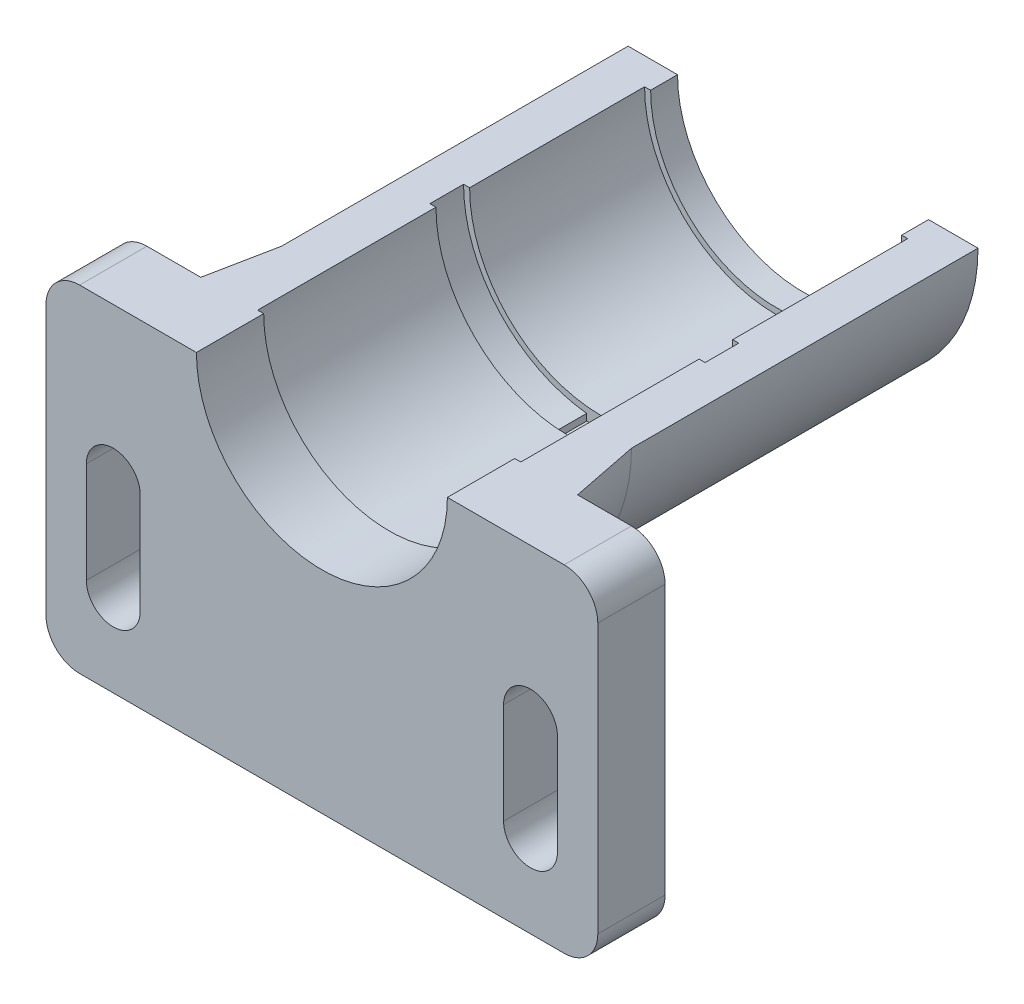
ISO-10303-21;
HEADER;
FILE_DESCRIPTION(('STEP AP214'),'2;1');
FILE_NAME('part.step','',(''),(''),'','','');
FILE_SCHEMA(('AUTOMOTIVE_DESIGN { 1 0 10303 214 1 1 1 1 }'));
ENDSEC;
DATA;
#1=APPLICATION_CONTEXT('core data for automotive mechanical design processes');
#2=APPLICATION_PROTOCOL_DEFINITION('international standard','automotive_design',2000,#1);
#3=PRODUCT_CONTEXT('',#1,'mechanical');
#4=PRODUCT('Part','Part','',(#3));
#5=PRODUCT_RELATED_PRODUCT_CATEGORY('part','',(#4));
#6=PRODUCT_DEFINITION_FORMATION('','',#4);
#7=PRODUCT_DEFINITION_CONTEXT('part definition',#1,'design');
#8=PRODUCT_DEFINITION('design','',#6,#7);
#9=PRODUCT_DEFINITION_SHAPE('','',#8);
#10=(LENGTH_UNIT() NAMED_UNIT(*) SI_UNIT(.MILLI.,.METRE.));
#11=(NAMED_UNIT(*) PLANE_ANGLE_UNIT() SI_UNIT($,.RADIAN.));
#12=(NAMED_UNIT(*) SI_UNIT($,.STERADIAN.) SOLID_ANGLE_UNIT());
#13=UNCERTAINTY_MEASURE_WITH_UNIT(LENGTH_MEASURE(1.E-05),#10,'distance_accuracy_value','');
#14=(GEOMETRIC_REPRESENTATION_CONTEXT(3) GLOBAL_UNCERTAINTY_ASSIGNED_CONTEXT((#13)) GLOBAL_UNIT_ASSIGNED_CONTEXT((#10,
#11,#12)) REPRESENTATION_CONTEXT('',''));
#15=CARTESIAN_POINT('',(0.,0.,0.));
#16=DIRECTION('',(0.,0.,1.));
#17=DIRECTION('',(1.,0.,0.));
#18=AXIS2_PLACEMENT_3D('',#15,#16,#17);
#19=CARTESIAN_POINT('',(19.55,0.,57.5));
#20=DIRECTION('',(0.,-1.,0.));
#21=DIRECTION('',(0.,0.,-1.));
#22=AXIS2_PLACEMENT_3D('',#19,#20,#21);
#23=PLANE('',#22);
#24=DIRECTION('',(-1.,0.,0.));
#25=VECTOR('',#24,1.);
#26=CARTESIAN_POINT('',(18.65,0.,67.5));
#27=LINE('',#26,#25);
#28=CARTESIAN_POINT('',(36.,0.,67.5));
#29=VERTEX_POINT('',#28);
#30=CARTESIAN_POINT('',(18.65,0.,67.5));
#31=VERTEX_POINT('',#30);
#32=EDGE_CURVE('E415',#29,#31,#27,.T.);
#33=ORIENTED_EDGE('',*,*,#32,.F.);
#34=DIRECTION('',(0.,0.,-1.));
#35=VECTOR('',#34,1.);
#36=CARTESIAN_POINT('',(36.,0.,57.5));
#37=LINE('',#36,#35);
#38=CARTESIAN_POINT('',(36.,0.,57.5));
#39=VERTEX_POINT('',#38);
#40=EDGE_CURVE('E491',#29,#39,#37,.T.);
#41=ORIENTED_EDGE('',*,*,#40,.T.);
#42=DIRECTION('',(-1.,0.,0.));
#43=VECTOR('',#42,1.);
#44=CARTESIAN_POINT('',(18.65,0.,57.5));
#45=LINE('',#44,#43);
#46=CARTESIAN_POINT('',(28.,0.,57.5));
#47=VERTEX_POINT('',#46);
#48=EDGE_CURVE('E431',#39,#47,#45,.T.);
#49=ORIENTED_EDGE('',*,*,#48,.T.);
#50=DIRECTION('',(0.196116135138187,0.,0.98058067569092));
#51=VECTOR('',#50,1.);
#52=CARTESIAN_POINT('',(0.,0.,-82.499999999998));
#53=LINE('',#52,#51);
#54=CARTESIAN_POINT('',(26.,0.,47.5000000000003));
#55=VERTEX_POINT('',#54);
#56=EDGE_CURVE('E465',#47,#55,#53,.F.);
#57=ORIENTED_EDGE('',*,*,#56,.T.);
#58=DIRECTION('',(0.,0.,-1.));
#59=VECTOR('',#58,1.);
#60=CARTESIAN_POINT('',(26.,0.,57.5));
#61=LINE('',#60,#59);
#62=CARTESIAN_POINT('',(26.,0.,-4.));
#63=VERTEX_POINT('',#62);
#64=EDGE_CURVE('E259',#55,#63,#61,.T.);
#65=ORIENTED_EDGE('',*,*,#64,.T.);
#66=DIRECTION('',(1.,0.,0.));
#67=VECTOR('',#66,1.);
#68=CARTESIAN_POINT('',(18.65,0.,-4.));
#69=LINE('',#68,#67);
#70=CARTESIAN_POINT('',(18.65,0.,-4.));
#71=VERTEX_POINT('',#70);
#72=EDGE_CURVE('E252',#71,#63,#69,.T.);
#73=ORIENTED_EDGE('',*,*,#72,.F.);
#74=DIRECTION('',(0.,0.,1.));
#75=VECTOR('',#74,1.);
#76=CARTESIAN_POINT('',(18.65,0.,-4.));
#77=LINE('',#76,#75);
#78=CARTESIAN_POINT('',(18.65,0.,0.));
#79=VERTEX_POINT('',#78);
#80=EDGE_CURVE('E256',#71,#79,#77,.T.);
#81=ORIENTED_EDGE('',*,*,#80,.T.);
#82=DIRECTION('',(1.,0.,0.));
#83=VECTOR('',#82,1.);
#84=CARTESIAN_POINT('',(18.65,0.,0.));
#85=LINE('',#84,#83);
#86=CARTESIAN_POINT('',(19.55,0.,0.));
#87=VERTEX_POINT('',#86);
#88=EDGE_CURVE('E536',#79,#87,#85,.T.);
#89=ORIENTED_EDGE('',*,*,#88,.T.);
#90=DIRECTION('',(0.,0.,-1.));
#91=VECTOR('',#90,1.);
#92=CARTESIAN_POINT('',(19.55,0.,57.5));
#93=LINE('',#92,#91);
#94=CARTESIAN_POINT('',(19.55,0.,26.));
#95=VERTEX_POINT('',#94);
#96=EDGE_CURVE('E455',#95,#87,#93,.T.);
#97=ORIENTED_EDGE('',*,*,#96,.F.);
#98=DIRECTION('',(1.,0.,0.));
#99=VECTOR('',#98,1.);
#100=CARTESIAN_POINT('',(0.,0.,26.));
#101=LINE('',#100,#99);
#102=CARTESIAN_POINT('',(20.45,0.,26.));
#103=VERTEX_POINT('',#102);
#104=EDGE_CURVE('E382',#95,#103,#101,.T.);
#105=ORIENTED_EDGE('',*,*,#104,.T.);
#106=DIRECTION('',(0.,0.,-1.));
#107=VECTOR('',#106,1.);
#108=CARTESIAN_POINT('',(20.45,0.,31.));
#109=LINE('',#108,#107);
#110=CARTESIAN_POINT('',(20.45,0.,31.));
#111=VERTEX_POINT('',#110);
#112=EDGE_CURVE('E400',#111,#103,#109,.T.);
#113=ORIENTED_EDGE('',*,*,#112,.F.);
#114=DIRECTION('',(1.,0.,0.));
#115=VECTOR('',#114,1.);
#116=CARTESIAN_POINT('',(0.,0.,31.));
#117=LINE('',#116,#115);
#118=CARTESIAN_POINT('',(19.55,0.,31.));
#119=VERTEX_POINT('',#118);
#120=EDGE_CURVE('E359',#119,#111,#117,.T.);
#121=ORIENTED_EDGE('',*,*,#120,.F.);
#122=CARTESIAN_POINT('',(19.55,0.,57.5));
#123=VERTEX_POINT('',#122);
#124=EDGE_CURVE('E456',#123,#119,#93,.T.);
#125=ORIENTED_EDGE('',*,*,#124,.F.);
#126=CARTESIAN_POINT('',(18.65,0.,57.5));
#127=VERTEX_POINT('',#126);
#128=EDGE_CURVE('E430',#123,#127,#45,.T.);
#129=ORIENTED_EDGE('',*,*,#128,.T.);
#130=DIRECTION('',(0.,0.,-1.));
#131=VECTOR('',#130,1.);
#132=CARTESIAN_POINT('',(18.65,0.,67.5));
#133=LINE('',#132,#131);
#134=EDGE_CURVE('E440',#31,#127,#133,.T.);
#135=ORIENTED_EDGE('',*,*,#134,.F.);
#136=EDGE_LOOP('',(#33,#41,#49,#57,#65,#73,#81,#89,#97,#105,#113,#121,#125,#129,#135));
#137=FACE_BOUND('',#136,.T.);
#138=ADVANCED_FACE('F36',(#137),#23,.F.);
#139=CARTESIAN_POINT('',(0.,0.,57.5));
#140=DIRECTION('',(0.,0.,-1.));
#141=DIRECTION('',(-1.,0.,0.));
#142=AXIS2_PLACEMENT_3D('',#139,#140,#141);
#143=CYLINDRICAL_SURFACE('',#142,19.55);
#144=CARTESIAN_POINT('',(0.,0.,31.));
#145=DIRECTION('',(0.,0.,-1.));
#146=DIRECTION('',(-1.,0.,0.));
#147=AXIS2_PLACEMENT_3D('',#144,#145,#146);
#148=CIRCLE('',#147,19.55);
#149=CARTESIAN_POINT('',(-19.55,0.,31.));
#150=VERTEX_POINT('',#149);
#151=EDGE_CURVE('E357',#150,#119,#148,.F.);
#152=ORIENTED_EDGE('',*,*,#151,.F.);
#153=DIRECTION('',(0.,0.,-1.));
#154=VECTOR('',#153,1.);
#155=CARTESIAN_POINT('',(-19.55,0.,57.5));
#156=LINE('',#155,#154);
#157=CARTESIAN_POINT('',(-19.55,0.,57.5));
#158=VERTEX_POINT('',#157);
#159=EDGE_CURVE('E452',#158,#150,#156,.T.);
#160=ORIENTED_EDGE('',*,*,#159,.F.);
#161=CARTESIAN_POINT('',(0.,0.,57.5));
#162=DIRECTION('',(0.,0.,-1.));
#163=DIRECTION('',(1.,0.,0.));
#164=AXIS2_PLACEMENT_3D('',#161,#162,#163);
#165=CIRCLE('',#164,19.55);
#166=EDGE_CURVE('E444',#123,#158,#165,.T.);
#167=ORIENTED_EDGE('',*,*,#166,.F.);
#168=ORIENTED_EDGE('',*,*,#124,.T.);
#169=EDGE_LOOP('',(#152,#160,#167,#168));
#170=FACE_BOUND('',#169,.T.);
#171=ADVANCED_FACE('F577',(#170),#143,.F.);
#172=CARTESIAN_POINT('',(-26.,0.,57.5));
#173=DIRECTION('',(0.,-1.,0.));
#174=DIRECTION('',(0.,0.,-1.));
#175=AXIS2_PLACEMENT_3D('',#172,#173,#174);
#176=PLANE('',#175);
#177=DIRECTION('',(-1.,0.,0.));
#178=VECTOR('',#177,1.);
#179=CARTESIAN_POINT('',(-41.,0.,57.5));
#180=LINE('',#179,#178);
#181=CARTESIAN_POINT('',(-28.,0.,57.5));
#182=VERTEX_POINT('',#181);
#183=CARTESIAN_POINT('',(-36.,0.,57.5));
#184=VERTEX_POINT('',#183);
#185=EDGE_CURVE('E435',#182,#184,#180,.T.);
#186=ORIENTED_EDGE('',*,*,#185,.T.);
#187=DIRECTION('',(0.,0.,-1.));
#188=VECTOR('',#187,1.);
#189=CARTESIAN_POINT('',(-36.,0.,57.5));
#190=LINE('',#189,#188);
#191=CARTESIAN_POINT('',(-36.,0.,67.5));
#192=VERTEX_POINT('',#191);
#193=EDGE_CURVE('E482',#184,#192,#190,.F.);
#194=ORIENTED_EDGE('',*,*,#193,.T.);
#195=DIRECTION('',(-1.,0.,0.));
#196=VECTOR('',#195,1.);
#197=CARTESIAN_POINT('',(-41.,0.,67.5));
#198=LINE('',#197,#196);
#199=CARTESIAN_POINT('',(-18.65,0.,67.5));
#200=VERTEX_POINT('',#199);
#201=EDGE_CURVE('E419',#200,#192,#198,.T.);
#202=ORIENTED_EDGE('',*,*,#201,.F.);
#203=DIRECTION('',(0.,0.,-1.));
#204=VECTOR('',#203,1.);
#205=CARTESIAN_POINT('',(-18.65,0.,67.5));
#206=LINE('',#205,#204);
#207=CARTESIAN_POINT('',(-18.65,0.,57.5));
#208=VERTEX_POINT('',#207);
#209=EDGE_CURVE('E422',#200,#208,#206,.T.);
#210=ORIENTED_EDGE('',*,*,#209,.T.);
#211=EDGE_CURVE('E410',#208,#158,#180,.T.);
#212=ORIENTED_EDGE('',*,*,#211,.T.);
#213=ORIENTED_EDGE('',*,*,#159,.T.);
#214=DIRECTION('',(1.,0.,0.));
#215=VECTOR('',#214,1.);
#216=CARTESIAN_POINT('',(0.,0.,31.));
#217=LINE('',#216,#215);
#218=CARTESIAN_POINT('',(-20.45,0.,31.));
#219=VERTEX_POINT('',#218);
#220=EDGE_CURVE('E355',#219,#150,#217,.T.);
#221=ORIENTED_EDGE('',*,*,#220,.F.);
#222=DIRECTION('',(0.,0.,-1.));
#223=VECTOR('',#222,1.);
#224=CARTESIAN_POINT('',(-20.45,0.,31.));
#225=LINE('',#224,#223);
#226=CARTESIAN_POINT('',(-20.45,0.,26.));
#227=VERTEX_POINT('',#226);
#228=EDGE_CURVE('E402',#219,#227,#225,.T.);
#229=ORIENTED_EDGE('',*,*,#228,.T.);
#230=DIRECTION('',(1.,0.,0.));
#231=VECTOR('',#230,1.);
#232=CARTESIAN_POINT('',(0.,0.,26.));
#233=LINE('',#232,#231);
#234=CARTESIAN_POINT('',(-19.55,0.,26.));
#235=VERTEX_POINT('',#234);
#236=EDGE_CURVE('E376',#227,#235,#233,.T.);
#237=ORIENTED_EDGE('',*,*,#236,.T.);
#238=CARTESIAN_POINT('',(-19.55,0.,0.));
#239=VERTEX_POINT('',#238);
#240=EDGE_CURVE('E451',#235,#239,#156,.T.);
#241=ORIENTED_EDGE('',*,*,#240,.T.);
#242=DIRECTION('',(1.,0.,0.));
#243=VECTOR('',#242,1.);
#244=CARTESIAN_POINT('',(-26.,0.,0.));
#245=LINE('',#244,#243);
#246=CARTESIAN_POINT('',(-18.65,0.,0.));
#247=VERTEX_POINT('',#246);
#248=EDGE_CURVE('E273',#239,#247,#245,.T.);
#249=ORIENTED_EDGE('',*,*,#248,.T.);
#250=DIRECTION('',(0.,0.,1.));
#251=VECTOR('',#250,1.);
#252=CARTESIAN_POINT('',(-18.65,0.,-4.));
#253=LINE('',#252,#251);
#254=CARTESIAN_POINT('',(-18.65,0.,-4.));
#255=VERTEX_POINT('',#254);
#256=EDGE_CURVE('E279',#255,#247,#253,.T.);
#257=ORIENTED_EDGE('',*,*,#256,.F.);
#258=DIRECTION('',(1.,0.,0.));
#259=VECTOR('',#258,1.);
#260=CARTESIAN_POINT('',(-26.,0.,-4.));
#261=LINE('',#260,#259);
#262=CARTESIAN_POINT('',(-26.,0.,-4.));
#263=VERTEX_POINT('',#262);
#264=EDGE_CURVE('E269',#263,#255,#261,.T.);
#265=ORIENTED_EDGE('',*,*,#264,.F.);
#266=DIRECTION('',(0.,0.,-1.));
#267=VECTOR('',#266,1.);
#268=CARTESIAN_POINT('',(-26.,0.,57.5));
#269=LINE('',#268,#267);
#270=CARTESIAN_POINT('',(-26.,0.,47.5000000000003));
#271=VERTEX_POINT('',#270);
#272=EDGE_CURVE('E447',#271,#263,#269,.T.);
#273=ORIENTED_EDGE('',*,*,#272,.F.);
#274=DIRECTION('',(0.196116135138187,0.,-0.98058067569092));
#275=VECTOR('',#274,1.);
#276=CARTESIAN_POINT('',(0.,0.,-82.499999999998));
#277=LINE('',#276,#275);
#278=EDGE_CURVE('E467',#271,#182,#277,.F.);
#279=ORIENTED_EDGE('',*,*,#278,.T.);
#280=EDGE_LOOP('',(#186,#194,#202,#210,#212,#213,#221,#229,#237,#241,#249,#257,#265,#273,#279));
#281=FACE_BOUND('',#280,.T.);
#282=ADVANCED_FACE('F539',(#281),#176,.F.);
#283=CARTESIAN_POINT('',(0.,0.,57.5));
#284=DIRECTION('',(0.,0.,-1.));
#285=DIRECTION('',(-1.,0.,0.));
#286=AXIS2_PLACEMENT_3D('',#283,#284,#285);
#287=CYLINDRICAL_SURFACE('',#286,26.);
#288=ORIENTED_EDGE('',*,*,#64,.F.);
#289=CARTESIAN_POINT('',(0.,0.,47.5000000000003));
#290=DIRECTION('',(0.,0.,1.));
#291=DIRECTION('',(1.,0.,0.));
#292=AXIS2_PLACEMENT_3D('',#289,#290,#291);
#293=CIRCLE('',#292,26.);
#294=EDGE_CURVE('E463',#55,#271,#293,.F.);
#295=ORIENTED_EDGE('',*,*,#294,.T.);
#296=ORIENTED_EDGE('',*,*,#272,.T.);
#297=CARTESIAN_POINT('',(0.,0.,-4.));
#298=DIRECTION('',(0.,0.,-1.));
#299=DIRECTION('',(-1.,0.,0.));
#300=AXIS2_PLACEMENT_3D('',#297,#298,#299);
#301=CIRCLE('',#300,26.);
#302=EDGE_CURVE('E263',#63,#263,#301,.T.);
#303=ORIENTED_EDGE('',*,*,#302,.F.);
#304=EDGE_LOOP('',(#288,#295,#296,#303));
#305=FACE_BOUND('',#304,.T.);
#306=ADVANCED_FACE('F530',(#305),#287,.T.);
#307=ORIENTED_EDGE('',*,*,#240,.F.);
#308=CARTESIAN_POINT('',(0.,0.,26.));
#309=DIRECTION('',(0.,0.,-1.));
#310=DIRECTION('',(-1.,0.,0.));
#311=AXIS2_PLACEMENT_3D('',#308,#309,#310);
#312=CIRCLE('',#311,19.55);
#313=EDGE_CURVE('E379',#235,#95,#312,.F.);
#314=ORIENTED_EDGE('',*,*,#313,.T.);
#315=ORIENTED_EDGE('',*,*,#96,.T.);
#316=CARTESIAN_POINT('',(0.,0.,0.));
#317=DIRECTION('',(0.,0.,-1.));
#318=DIRECTION('',(1.,0.,0.));
#319=AXIS2_PLACEMENT_3D('',#316,#317,#318);
#320=CIRCLE('',#319,19.55);
#321=EDGE_CURVE('E443',#87,#239,#320,.T.);
#322=ORIENTED_EDGE('',*,*,#321,.T.);
#323=EDGE_LOOP('',(#307,#314,#315,#322));
#324=FACE_BOUND('',#323,.T.);
#325=ADVANCED_FACE('F546',(#324),#143,.F.);
#326=CARTESIAN_POINT('',(0.,0.,57.5));
#327=DIRECTION('',(0.,0.,1.));
#328=DIRECTION('',(1.,0.,0.));
#329=AXIS2_PLACEMENT_3D('',#326,#327,#328);
#330=PLANE('',#329);
#331=DIRECTION('',(0.,-1.,0.));
#332=VECTOR('',#331,1.);
#333=CARTESIAN_POINT('',(27.,0.,57.5));
#334=LINE('',#333,#332);
#335=CARTESIAN_POINT('',(27.,-22.5,57.5));
#336=VERTEX_POINT('',#335);
#337=CARTESIAN_POINT('',(27.,-37.5,57.5));
#338=VERTEX_POINT('',#337);
#339=EDGE_CURVE('E341',#336,#338,#334,.T.);
#340=ORIENTED_EDGE('',*,*,#339,.T.);
#341=CARTESIAN_POINT('',(31.,-37.5,57.5));
#342=DIRECTION('',(0.,0.,1.));
#343=DIRECTION('',(1.,0.,0.));
#344=AXIS2_PLACEMENT_3D('',#341,#342,#343);
#345=CIRCLE('',#344,4.);
#346=CARTESIAN_POINT('',(35.,-37.5,57.5));
#347=VERTEX_POINT('',#346);
#348=EDGE_CURVE('E344',#338,#347,#345,.T.);
#349=ORIENTED_EDGE('',*,*,#348,.T.);
#350=DIRECTION('',(0.,1.,0.));
#351=VECTOR('',#350,1.);
#352=CARTESIAN_POINT('',(35.,0.,57.5));
#353=LINE('',#352,#351);
#354=CARTESIAN_POINT('',(35.,-22.5,57.5));
#355=VERTEX_POINT('',#354);
#356=EDGE_CURVE('E335',#347,#355,#353,.T.);
#357=ORIENTED_EDGE('',*,*,#356,.T.);
#358=CARTESIAN_POINT('',(31.,-22.5,57.5));
#359=DIRECTION('',(0.,0.,1.));
#360=DIRECTION('',(1.,0.,0.));
#361=AXIS2_PLACEMENT_3D('',#358,#359,#360);
#362=CIRCLE('',#361,4.00000000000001);
#363=EDGE_CURVE('E338',#355,#336,#362,.T.);
#364=ORIENTED_EDGE('',*,*,#363,.T.);
#365=EDGE_LOOP('',(#340,#349,#357,#364));
#366=FACE_BOUND('',#365,.T.);
#367=DIRECTION('',(0.,-1.,0.));
#368=VECTOR('',#367,1.);
#369=CARTESIAN_POINT('',(-35.,0.,57.5));
#370=LINE('',#369,#368);
#371=CARTESIAN_POINT('',(-35.,-22.5,57.5));
#372=VERTEX_POINT('',#371);
#373=CARTESIAN_POINT('',(-35.,-37.5,57.5));
#374=VERTEX_POINT('',#373);
#375=EDGE_CURVE('E329',#372,#374,#370,.T.);
#376=ORIENTED_EDGE('',*,*,#375,.T.);
#377=CARTESIAN_POINT('',(-31.,-37.5,57.5));
#378=DIRECTION('',(0.,0.,1.));
#379=DIRECTION('',(1.,0.,0.));
#380=AXIS2_PLACEMENT_3D('',#377,#378,#379);
#381=CIRCLE('',#380,4.00000000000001);
#382=CARTESIAN_POINT('',(-27.,-37.5,57.5));
#383=VERTEX_POINT('',#382);
#384=EDGE_CURVE('E332',#374,#383,#381,.T.);
#385=ORIENTED_EDGE('',*,*,#384,.T.);
#386=DIRECTION('',(0.,1.,0.));
#387=VECTOR('',#386,1.);
#388=CARTESIAN_POINT('',(-27.,0.,57.5));
#389=LINE('',#388,#387);
#390=CARTESIAN_POINT('',(-27.,-22.5,57.5));
#391=VERTEX_POINT('',#390);
#392=EDGE_CURVE('E301',#383,#391,#389,.T.);
#393=ORIENTED_EDGE('',*,*,#392,.T.);
#394=CARTESIAN_POINT('',(-31.,-22.5,57.5));
#395=DIRECTION('',(0.,0.,1.));
#396=DIRECTION('',(1.,0.,0.));
#397=AXIS2_PLACEMENT_3D('',#394,#395,#396);
#398=CIRCLE('',#397,4.00000000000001);
#399=EDGE_CURVE('E326',#391,#372,#398,.T.);
#400=ORIENTED_EDGE('',*,*,#399,.T.);
#401=EDGE_LOOP('',(#376,#385,#393,#400));
#402=FACE_BOUND('',#401,.T.);
#403=DIRECTION('',(0.,-1.,0.));
#404=VECTOR('',#403,1.);
#405=CARTESIAN_POINT('',(-41.,0.,57.5));
#406=LINE('',#405,#404);
#407=CARTESIAN_POINT('',(-41.,-5.,57.5));
#408=VERTEX_POINT('',#407);
#409=CARTESIAN_POINT('',(-41.,-45.,57.5));
#410=VERTEX_POINT('',#409);
#411=EDGE_CURVE('E395',#408,#410,#406,.T.);
#412=ORIENTED_EDGE('',*,*,#411,.F.);
#413=CARTESIAN_POINT('',(-36.,-5.,57.5));
#414=DIRECTION('',(0.,0.,1.));
#415=DIRECTION('',(1.,0.,0.));
#416=AXIS2_PLACEMENT_3D('',#413,#414,#415);
#417=CIRCLE('',#416,5.);
#418=EDGE_CURVE('E480',#408,#184,#417,.F.);
#419=ORIENTED_EDGE('',*,*,#418,.T.);
#420=ORIENTED_EDGE('',*,*,#185,.F.);
#421=CARTESIAN_POINT('',(0.,0.,57.5));
#422=DIRECTION('',(0.,0.,1.));
#423=DIRECTION('',(1.,0.,0.));
#424=AXIS2_PLACEMENT_3D('',#421,#422,#423);
#425=CIRCLE('',#424,28.);
#426=EDGE_CURVE('E460',#182,#47,#425,.T.);
#427=ORIENTED_EDGE('',*,*,#426,.T.);
#428=ORIENTED_EDGE('',*,*,#48,.F.);
#429=CARTESIAN_POINT('',(36.,-5.,57.5));
#430=DIRECTION('',(0.,0.,1.));
#431=DIRECTION('',(1.,0.,0.));
#432=AXIS2_PLACEMENT_3D('',#429,#430,#431);
#433=CIRCLE('',#432,5.);
#434=CARTESIAN_POINT('',(41.,-5.,57.5));
#435=VERTEX_POINT('',#434);
#436=EDGE_CURVE('E478',#39,#435,#433,.F.);
#437=ORIENTED_EDGE('',*,*,#436,.T.);
#438=DIRECTION('',(0.,1.,0.));
#439=VECTOR('',#438,1.);
#440=CARTESIAN_POINT('',(41.,0.,57.5));
#441=LINE('',#440,#439);
#442=CARTESIAN_POINT('',(41.,-45.,57.5));
#443=VERTEX_POINT('',#442);
#444=EDGE_CURVE('E428',#443,#435,#441,.T.);
#445=ORIENTED_EDGE('',*,*,#444,.F.);
#446=CARTESIAN_POINT('',(36.,-45.,57.5));
#447=DIRECTION('',(0.,0.,1.));
#448=DIRECTION('',(1.,0.,0.));
#449=AXIS2_PLACEMENT_3D('',#446,#447,#448);
#450=CIRCLE('',#449,5.);
#451=CARTESIAN_POINT('',(36.,-50.,57.5));
#452=VERTEX_POINT('',#451);
#453=EDGE_CURVE('E476',#443,#452,#450,.F.);
#454=ORIENTED_EDGE('',*,*,#453,.T.);
#455=DIRECTION('',(1.,0.,0.));
#456=VECTOR('',#455,1.);
#457=CARTESIAN_POINT('',(-41.,-50.,57.5));
#458=LINE('',#457,#456);
#459=CARTESIAN_POINT('',(-36.,-50.,57.5));
#460=VERTEX_POINT('',#459);
#461=EDGE_CURVE('E425',#460,#452,#458,.T.);
#462=ORIENTED_EDGE('',*,*,#461,.F.);
#463=CARTESIAN_POINT('',(-36.,-45.,57.5));
#464=DIRECTION('',(0.,0.,1.));
#465=DIRECTION('',(1.,0.,0.));
#466=AXIS2_PLACEMENT_3D('',#463,#464,#465);
#467=CIRCLE('',#466,5.);
#468=EDGE_CURVE('E474',#460,#410,#467,.F.);
#469=ORIENTED_EDGE('',*,*,#468,.T.);
#470=EDGE_LOOP('',(#412,#419,#420,#427,#428,#437,#445,#454,#462,#469));
#471=FACE_BOUND('',#470,.T.);
#472=ADVANCED_FACE('F508',(#366,#402,#471),#330,.F.);
#473=ORIENTED_EDGE('',*,*,#128,.F.);
#474=ORIENTED_EDGE('',*,*,#166,.T.);
#475=ORIENTED_EDGE('',*,*,#211,.F.);
#476=CARTESIAN_POINT('',(0.,0.,57.5));
#477=DIRECTION('',(0.,0.,-1.));
#478=DIRECTION('',(1.,0.,0.));
#479=AXIS2_PLACEMENT_3D('',#476,#477,#478);
#480=CIRCLE('',#479,18.65);
#481=EDGE_CURVE('E433',#127,#208,#480,.T.);
#482=ORIENTED_EDGE('',*,*,#481,.F.);
#483=EDGE_LOOP('',(#473,#474,#475,#482));
#484=FACE_BOUND('',#483,.T.);
#485=ADVANCED_FACE('F582',(#484),#330,.F.);
#486=CARTESIAN_POINT('',(-41.,0.,67.5));
#487=DIRECTION('',(1.,0.,0.));
#488=DIRECTION('',(0.,0.,-1.));
#489=AXIS2_PLACEMENT_3D('',#486,#487,#488);
#490=PLANE('',#489);
#491=DIRECTION('',(0.,-1.,0.));
#492=VECTOR('',#491,1.);
#493=CARTESIAN_POINT('',(-41.,0.,67.5));
#494=LINE('',#493,#492);
#495=CARTESIAN_POINT('',(-41.,-5.,67.5));
#496=VERTEX_POINT('',#495);
#497=CARTESIAN_POINT('',(-41.,-45.,67.5));
#498=VERTEX_POINT('',#497);
#499=EDGE_CURVE('E406',#496,#498,#494,.T.);
#500=ORIENTED_EDGE('',*,*,#499,.F.);
#501=DIRECTION('',(0.,0.,-1.));
#502=VECTOR('',#501,1.);
#503=CARTESIAN_POINT('',(-41.,-5.,67.5));
#504=LINE('',#503,#502);
#505=EDGE_CURVE('E471',#496,#408,#504,.T.);
#506=ORIENTED_EDGE('',*,*,#505,.T.);
#507=ORIENTED_EDGE('',*,*,#411,.T.);
#508=DIRECTION('',(0.,0.,-1.));
#509=VECTOR('',#508,1.);
#510=CARTESIAN_POINT('',(-41.,-45.,67.5));
#511=LINE('',#510,#509);
#512=EDGE_CURVE('E469',#410,#498,#511,.F.);
#513=ORIENTED_EDGE('',*,*,#512,.T.);
#514=EDGE_LOOP('',(#500,#506,#507,#513));
#515=FACE_BOUND('',#514,.T.);
#516=ADVANCED_FACE('F595',(#515),#490,.F.);
#517=CARTESIAN_POINT('',(-41.,-50.,67.5));
#518=DIRECTION('',(0.,1.,0.));
#519=DIRECTION('',(0.,0.,1.));
#520=AXIS2_PLACEMENT_3D('',#517,#518,#519);
#521=PLANE('',#520);
#522=ORIENTED_EDGE('',*,*,#461,.T.);
#523=DIRECTION('',(0.,0.,-1.));
#524=VECTOR('',#523,1.);
#525=CARTESIAN_POINT('',(36.,-50.,67.5));
#526=LINE('',#525,#524);
#527=CARTESIAN_POINT('',(36.,-50.,67.5));
#528=VERTEX_POINT('',#527);
#529=EDGE_CURVE('E11',#452,#528,#526,.F.);
#530=ORIENTED_EDGE('',*,*,#529,.T.);
#531=DIRECTION('',(1.,0.,0.));
#532=VECTOR('',#531,1.);
#533=CARTESIAN_POINT('',(-41.,-50.,67.5));
#534=LINE('',#533,#532);
#535=CARTESIAN_POINT('',(-36.,-50.,67.5));
#536=VERTEX_POINT('',#535);
#537=EDGE_CURVE('E409',#536,#528,#534,.T.);
#538=ORIENTED_EDGE('',*,*,#537,.F.);
#539=DIRECTION('',(0.,0.,-1.));
#540=VECTOR('',#539,1.);
#541=CARTESIAN_POINT('',(-36.,-50.,67.5));
#542=LINE('',#541,#540);
#543=EDGE_CURVE('E44',#536,#460,#542,.T.);
#544=ORIENTED_EDGE('',*,*,#543,.T.);
#545=EDGE_LOOP('',(#522,#530,#538,#544));
#546=FACE_BOUND('',#545,.T.);
#547=ADVANCED_FACE('F502',(#546),#521,.F.);
#548=CARTESIAN_POINT('',(41.,0.,67.5));
#549=DIRECTION('',(-1.,0.,0.));
#550=DIRECTION('',(0.,-1.,0.));
#551=AXIS2_PLACEMENT_3D('',#548,#549,#550);
#552=PLANE('',#551);
#553=ORIENTED_EDGE('',*,*,#444,.T.);
#554=DIRECTION('',(0.,0.,-1.));
#555=VECTOR('',#554,1.);
#556=CARTESIAN_POINT('',(41.,-5.,67.5));
#557=LINE('',#556,#555);
#558=CARTESIAN_POINT('',(41.,-5.,67.5));
#559=VERTEX_POINT('',#558);
#560=EDGE_CURVE('E59',#435,#559,#557,.F.);
#561=ORIENTED_EDGE('',*,*,#560,.T.);
#562=DIRECTION('',(0.,1.,0.));
#563=VECTOR('',#562,1.);
#564=CARTESIAN_POINT('',(41.,0.,67.5));
#565=LINE('',#564,#563);
#566=CARTESIAN_POINT('',(41.,-45.,67.5));
#567=VERTEX_POINT('',#566);
#568=EDGE_CURVE('E413',#567,#559,#565,.T.);
#569=ORIENTED_EDGE('',*,*,#568,.F.);
#570=DIRECTION('',(0.,0.,-1.));
#571=VECTOR('',#570,1.);
#572=CARTESIAN_POINT('',(41.,-45.,67.5));
#573=LINE('',#572,#571);
#574=EDGE_CURVE('E494',#567,#443,#573,.T.);
#575=ORIENTED_EDGE('',*,*,#574,.T.);
#576=EDGE_LOOP('',(#553,#561,#569,#575));
#577=FACE_BOUND('',#576,.T.);
#578=ADVANCED_FACE('F514',(#577),#552,.F.);
#579=CARTESIAN_POINT('',(0.,0.,67.5));
#580=DIRECTION('',(0.,0.,-1.));
#581=DIRECTION('',(-1.,0.,0.));
#582=AXIS2_PLACEMENT_3D('',#579,#580,#581);
#583=CYLINDRICAL_SURFACE('',#582,18.65);
#584=ORIENTED_EDGE('',*,*,#481,.T.);
#585=ORIENTED_EDGE('',*,*,#209,.F.);
#586=CARTESIAN_POINT('',(0.,0.,67.5));
#587=DIRECTION('',(0.,0.,-1.));
#588=DIRECTION('',(1.,0.,0.));
#589=AXIS2_PLACEMENT_3D('',#586,#587,#588);
#590=CIRCLE('',#589,18.65);
#591=EDGE_CURVE('E417',#31,#200,#590,.T.);
#592=ORIENTED_EDGE('',*,*,#591,.F.);
#593=ORIENTED_EDGE('',*,*,#134,.T.);
#594=EDGE_LOOP('',(#584,#585,#592,#593));
#595=FACE_BOUND('',#594,.T.);
#596=ADVANCED_FACE('F585',(#595),#583,.F.);
#597=CARTESIAN_POINT('',(0.,0.,67.5));
#598=DIRECTION('',(0.,0.,1.));
#599=DIRECTION('',(1.,0.,0.));
#600=AXIS2_PLACEMENT_3D('',#597,#598,#599);
#601=PLANE('',#600);
#602=CARTESIAN_POINT('',(31.,-37.5,67.5));
#603=DIRECTION('',(0.,0.,1.));
#604=DIRECTION('',(1.,0.,0.));
#605=AXIS2_PLACEMENT_3D('',#602,#603,#604);
#606=CIRCLE('',#605,4.);
#607=CARTESIAN_POINT('',(27.,-37.5,67.5));
#608=VERTEX_POINT('',#607);
#609=CARTESIAN_POINT('',(35.,-37.5,67.5));
#610=VERTEX_POINT('',#609);
#611=EDGE_CURVE('E286',#608,#610,#606,.T.);
#612=ORIENTED_EDGE('',*,*,#611,.F.);
#613=DIRECTION('',(0.,-1.,0.));
#614=VECTOR('',#613,1.);
#615=CARTESIAN_POINT('',(27.,-37.5,67.5));
#616=LINE('',#615,#614);
#617=CARTESIAN_POINT('',(27.,-22.5,67.5));
#618=VERTEX_POINT('',#617);
#619=EDGE_CURVE('E295',#618,#608,#616,.T.);
#620=ORIENTED_EDGE('',*,*,#619,.F.);
#621=CARTESIAN_POINT('',(31.,-22.5,67.5));
#622=DIRECTION('',(0.,0.,1.));
#623=DIRECTION('',(1.,0.,0.));
#624=AXIS2_PLACEMENT_3D('',#621,#622,#623);
#625=CIRCLE('',#624,4.00000000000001);
#626=CARTESIAN_POINT('',(35.,-22.5,67.5));
#627=VERTEX_POINT('',#626);
#628=EDGE_CURVE('E292',#627,#618,#625,.T.);
#629=ORIENTED_EDGE('',*,*,#628,.F.);
#630=DIRECTION('',(0.,1.,0.));
#631=VECTOR('',#630,1.);
#632=CARTESIAN_POINT('',(35.,-37.5,67.5));
#633=LINE('',#632,#631);
#634=EDGE_CURVE('E288',#610,#627,#633,.T.);
#635=ORIENTED_EDGE('',*,*,#634,.F.);
#636=EDGE_LOOP('',(#612,#620,#629,#635));
#637=FACE_BOUND('',#636,.T.);
#638=CARTESIAN_POINT('',(-31.,-37.5,67.5));
#639=DIRECTION('',(0.,0.,1.));
#640=DIRECTION('',(-1.,0.,0.));
#641=AXIS2_PLACEMENT_3D('',#638,#639,#640);
#642=CIRCLE('',#641,4.00000000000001);
#643=CARTESIAN_POINT('',(-35.,-37.5,67.5));
#644=VERTEX_POINT('',#643);
#645=CARTESIAN_POINT('',(-27.,-37.5,67.5));
#646=VERTEX_POINT('',#645);
#647=EDGE_CURVE('E278',#644,#646,#642,.T.);
#648=ORIENTED_EDGE('',*,*,#647,.F.);
#649=DIRECTION('',(0.,-1.,0.));
#650=VECTOR('',#649,1.);
#651=CARTESIAN_POINT('',(-35.,-37.5,67.5));
#652=LINE('',#651,#650);
#653=CARTESIAN_POINT('',(-35.,-22.5,67.5));
#654=VERTEX_POINT('',#653);
#655=EDGE_CURVE('E313',#654,#644,#652,.T.);
#656=ORIENTED_EDGE('',*,*,#655,.F.);
#657=CARTESIAN_POINT('',(-31.,-22.5,67.5));
#658=DIRECTION('',(0.,0.,1.));
#659=DIRECTION('',(-1.,0.,0.));
#660=AXIS2_PLACEMENT_3D('',#657,#658,#659);
#661=CIRCLE('',#660,4.00000000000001);
#662=CARTESIAN_POINT('',(-27.,-22.5,67.5));
#663=VERTEX_POINT('',#662);
#664=EDGE_CURVE('E310',#663,#654,#661,.T.);
#665=ORIENTED_EDGE('',*,*,#664,.F.);
#666=DIRECTION('',(0.,1.,0.));
#667=VECTOR('',#666,1.);
#668=CARTESIAN_POINT('',(-27.,-37.5,67.5));
#669=LINE('',#668,#667);
#670=EDGE_CURVE('E281',#646,#663,#669,.T.);
#671=ORIENTED_EDGE('',*,*,#670,.F.);
#672=EDGE_LOOP('',(#648,#656,#665,#671));
#673=FACE_BOUND('',#672,.T.);
#674=ORIENTED_EDGE('',*,*,#201,.T.);
#675=CARTESIAN_POINT('',(-36.,-5.,67.5));
#676=DIRECTION('',(0.,0.,1.));
#677=DIRECTION('',(1.,0.,0.));
#678=AXIS2_PLACEMENT_3D('',#675,#676,#677);
#679=CIRCLE('',#678,5.);
#680=EDGE_CURVE('E489',#192,#496,#679,.T.);
#681=ORIENTED_EDGE('',*,*,#680,.T.);
#682=ORIENTED_EDGE('',*,*,#499,.T.);
#683=CARTESIAN_POINT('',(-36.,-45.,67.5));
#684=DIRECTION('',(0.,0.,1.));
#685=DIRECTION('',(1.,0.,0.));
#686=AXIS2_PLACEMENT_3D('',#683,#684,#685);
#687=CIRCLE('',#686,5.);
#688=EDGE_CURVE('E484',#498,#536,#687,.T.);
#689=ORIENTED_EDGE('',*,*,#688,.T.);
#690=ORIENTED_EDGE('',*,*,#537,.T.);
#691=CARTESIAN_POINT('',(36.,-45.,67.5));
#692=DIRECTION('',(0.,0.,1.));
#693=DIRECTION('',(1.,0.,0.));
#694=AXIS2_PLACEMENT_3D('',#691,#692,#693);
#695=CIRCLE('',#694,5.);
#696=EDGE_CURVE('E486',#528,#567,#695,.T.);
#697=ORIENTED_EDGE('',*,*,#696,.T.);
#698=ORIENTED_EDGE('',*,*,#568,.T.);
#699=CARTESIAN_POINT('',(36.,-5.,67.5));
#700=DIRECTION('',(0.,0.,1.));
#701=DIRECTION('',(1.,0.,0.));
#702=AXIS2_PLACEMENT_3D('',#699,#700,#701);
#703=CIRCLE('',#702,5.);
#704=EDGE_CURVE('E51',#559,#29,#703,.T.);
#705=ORIENTED_EDGE('',*,*,#704,.T.);
#706=ORIENTED_EDGE('',*,*,#32,.T.);
#707=ORIENTED_EDGE('',*,*,#591,.T.);
#708=EDGE_LOOP('',(#674,#681,#682,#689,#690,#697,#698,#705,#706,#707));
#709=FACE_BOUND('',#708,.T.);
#710=ADVANCED_FACE('F515',(#637,#673,#709),#601,.T.);
#711=CARTESIAN_POINT('',(-2.15,0.,31.));
#712=DIRECTION('',(-1.,0.,0.));
#713=DIRECTION('',(0.,0.,1.));
#714=AXIS2_PLACEMENT_3D('',#711,#712,#713);
#715=PLANE('',#714);
#716=DIRECTION('',(0.,1.,0.));
#717=VECTOR('',#716,1.);
#718=CARTESIAN_POINT('',(-2.15,0.,26.));
#719=LINE('',#718,#717);
#720=CARTESIAN_POINT('',(-2.15,-21.3366663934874,26.));
#721=VERTEX_POINT('',#720);
#722=CARTESIAN_POINT('',(-2.15,-20.3366663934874,26.));
#723=VERTEX_POINT('',#722);
#724=EDGE_CURVE('E347',#721,#723,#719,.T.);
#725=ORIENTED_EDGE('',*,*,#724,.T.);
#726=DIRECTION('',(0.,0.,-1.));
#727=VECTOR('',#726,1.);
#728=CARTESIAN_POINT('',(-2.15,-20.3366663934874,31.));
#729=LINE('',#728,#727);
#730=CARTESIAN_POINT('',(-2.15,-20.3366663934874,31.));
#731=VERTEX_POINT('',#730);
#732=EDGE_CURVE('E370',#731,#723,#729,.T.);
#733=ORIENTED_EDGE('',*,*,#732,.F.);
#734=DIRECTION('',(0.,1.,0.));
#735=VECTOR('',#734,1.);
#736=CARTESIAN_POINT('',(-2.15,0.,31.));
#737=LINE('',#736,#735);
#738=CARTESIAN_POINT('',(-2.15,-21.3366663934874,31.));
#739=VERTEX_POINT('',#738);
#740=EDGE_CURVE('E348',#739,#731,#737,.T.);
#741=ORIENTED_EDGE('',*,*,#740,.F.);
#742=DIRECTION('',(0.,0.,-1.));
#743=VECTOR('',#742,1.);
#744=CARTESIAN_POINT('',(-2.15,-21.3366663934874,31.));
#745=LINE('',#744,#743);
#746=EDGE_CURVE('E393',#739,#721,#745,.T.);
#747=ORIENTED_EDGE('',*,*,#746,.T.);
#748=EDGE_LOOP('',(#725,#733,#741,#747));
#749=FACE_BOUND('',#748,.T.);
#750=ADVANCED_FACE('F563',(#749),#715,.F.);
#751=CARTESIAN_POINT('',(0.,-21.3366663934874,31.));
#752=DIRECTION('',(0.,-1.,0.));
#753=DIRECTION('',(0.,0.,-1.));
#754=AXIS2_PLACEMENT_3D('',#751,#752,#753);
#755=PLANE('',#754);
#756=DIRECTION('',(-1.,0.,0.));
#757=VECTOR('',#756,1.);
#758=CARTESIAN_POINT('',(0.,-21.3366663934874,26.));
#759=LINE('',#758,#757);
#760=CARTESIAN_POINT('',(2.15,-21.3366663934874,26.));
#761=VERTEX_POINT('',#760);
#762=EDGE_CURVE('E352',#761,#721,#759,.T.);
#763=ORIENTED_EDGE('',*,*,#762,.T.);
#764=ORIENTED_EDGE('',*,*,#746,.F.);
#765=DIRECTION('',(-1.,0.,0.));
#766=VECTOR('',#765,1.);
#767=CARTESIAN_POINT('',(0.,-21.3366663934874,31.));
#768=LINE('',#767,#766);
#769=CARTESIAN_POINT('',(2.15,-21.3366663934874,31.));
#770=VERTEX_POINT('',#769);
#771=EDGE_CURVE('E367',#770,#739,#768,.T.);
#772=ORIENTED_EDGE('',*,*,#771,.F.);
#773=DIRECTION('',(0.,0.,-1.));
#774=VECTOR('',#773,1.);
#775=CARTESIAN_POINT('',(2.15,-21.3366663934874,31.));
#776=LINE('',#775,#774);
#777=EDGE_CURVE('E396',#770,#761,#776,.T.);
#778=ORIENTED_EDGE('',*,*,#777,.T.);
#779=EDGE_LOOP('',(#763,#764,#772,#778));
#780=FACE_BOUND('',#779,.T.);
#781=ADVANCED_FACE('F566',(#780),#755,.F.);
#782=CARTESIAN_POINT('',(2.15,0.,31.));
#783=DIRECTION('',(-1.,0.,0.));
#784=DIRECTION('',(0.,0.,1.));
#785=AXIS2_PLACEMENT_3D('',#782,#783,#784);
#786=PLANE('',#785);
#787=DIRECTION('',(0.,1.,0.));
#788=VECTOR('',#787,1.);
#789=CARTESIAN_POINT('',(2.15,0.,26.));
#790=LINE('',#789,#788);
#791=CARTESIAN_POINT('',(2.15,-20.3366663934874,26.));
#792=VERTEX_POINT('',#791);
#793=EDGE_CURVE('E388',#761,#792,#790,.T.);
#794=ORIENTED_EDGE('',*,*,#793,.F.);
#795=ORIENTED_EDGE('',*,*,#777,.F.);
#796=DIRECTION('',(0.,1.,0.));
#797=VECTOR('',#796,1.);
#798=CARTESIAN_POINT('',(2.15,0.,31.));
#799=LINE('',#798,#797);
#800=CARTESIAN_POINT('',(2.15,-20.3366663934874,31.));
#801=VERTEX_POINT('',#800);
#802=EDGE_CURVE('E365',#770,#801,#799,.T.);
#803=ORIENTED_EDGE('',*,*,#802,.T.);
#804=DIRECTION('',(0.,0.,-1.));
#805=VECTOR('',#804,1.);
#806=CARTESIAN_POINT('',(2.15,-20.3366663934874,31.));
#807=LINE('',#806,#805);
#808=EDGE_CURVE('E398',#801,#792,#807,.T.);
#809=ORIENTED_EDGE('',*,*,#808,.T.);
#810=EDGE_LOOP('',(#794,#795,#803,#809));
#811=FACE_BOUND('',#810,.T.);
#812=ADVANCED_FACE('F569',(#811),#786,.T.);
#813=CARTESIAN_POINT('',(0.,0.,31.));
#814=DIRECTION('',(0.,0.,-1.));
#815=DIRECTION('',(-1.,0.,0.));
#816=AXIS2_PLACEMENT_3D('',#813,#814,#815);
#817=CYLINDRICAL_SURFACE('',#816,20.45);
#818=CARTESIAN_POINT('',(0.,0.,26.));
#819=DIRECTION('',(0.,0.,-1.));
#820=DIRECTION('',(-1.,0.,0.));
#821=AXIS2_PLACEMENT_3D('',#818,#819,#820);
#822=CIRCLE('',#821,20.45);
#823=EDGE_CURVE('E385',#103,#792,#822,.T.);
#824=ORIENTED_EDGE('',*,*,#823,.T.);
#825=ORIENTED_EDGE('',*,*,#808,.F.);
#826=CARTESIAN_POINT('',(0.,0.,31.));
#827=DIRECTION('',(0.,0.,-1.));
#828=DIRECTION('',(-1.,0.,0.));
#829=AXIS2_PLACEMENT_3D('',#826,#827,#828);
#830=CIRCLE('',#829,20.45);
#831=EDGE_CURVE('E362',#111,#801,#830,.T.);
#832=ORIENTED_EDGE('',*,*,#831,.F.);
#833=ORIENTED_EDGE('',*,*,#112,.T.);
#834=EDGE_LOOP('',(#824,#825,#832,#833));
#835=FACE_BOUND('',#834,.T.);
#836=ADVANCED_FACE('F572',(#835),#817,.F.);
#837=CARTESIAN_POINT('',(0.,0.,31.));
#838=DIRECTION('',(0.,0.,-1.));
#839=DIRECTION('',(-1.,0.,0.));
#840=AXIS2_PLACEMENT_3D('',#837,#838,#839);
#841=CYLINDRICAL_SURFACE('',#840,20.45);
#842=CARTESIAN_POINT('',(0.,0.,26.));
#843=DIRECTION('',(0.,0.,-1.));
#844=DIRECTION('',(-1.,0.,0.));
#845=AXIS2_PLACEMENT_3D('',#842,#843,#844);
#846=CIRCLE('',#845,20.45);
#847=EDGE_CURVE('E373',#723,#227,#846,.T.);
#848=ORIENTED_EDGE('',*,*,#847,.T.);
#849=ORIENTED_EDGE('',*,*,#228,.F.);
#850=CARTESIAN_POINT('',(0.,0.,31.));
#851=DIRECTION('',(0.,0.,-1.));
#852=DIRECTION('',(-1.,0.,0.));
#853=AXIS2_PLACEMENT_3D('',#850,#851,#852);
#854=CIRCLE('',#853,20.45);
#855=EDGE_CURVE('E351',#731,#219,#854,.T.);
#856=ORIENTED_EDGE('',*,*,#855,.F.);
#857=ORIENTED_EDGE('',*,*,#732,.T.);
#858=EDGE_LOOP('',(#848,#849,#856,#857));
#859=FACE_BOUND('',#858,.T.);
#860=ADVANCED_FACE('F555',(#859),#841,.F.);
#861=CARTESIAN_POINT('',(0.,0.,31.));
#862=DIRECTION('',(0.,0.,-1.));
#863=DIRECTION('',(-1.,0.,0.));
#864=AXIS2_PLACEMENT_3D('',#861,#862,#863);
#865=PLANE('',#864);
#866=ORIENTED_EDGE('',*,*,#740,.T.);
#867=ORIENTED_EDGE('',*,*,#855,.T.);
#868=ORIENTED_EDGE('',*,*,#220,.T.);
#869=ORIENTED_EDGE('',*,*,#151,.T.);
#870=ORIENTED_EDGE('',*,*,#120,.T.);
#871=ORIENTED_EDGE('',*,*,#831,.T.);
#872=ORIENTED_EDGE('',*,*,#802,.F.);
#873=ORIENTED_EDGE('',*,*,#771,.T.);
#874=EDGE_LOOP('',(#866,#867,#868,#869,#870,#871,#872,#873));
#875=FACE_BOUND('',#874,.T.);
#876=ADVANCED_FACE('F557',(#875),#865,.T.);
#877=CARTESIAN_POINT('',(0.,0.,26.));
#878=DIRECTION('',(0.,0.,-1.));
#879=DIRECTION('',(-1.,0.,0.));
#880=AXIS2_PLACEMENT_3D('',#877,#878,#879);
#881=PLANE('',#880);
#882=ORIENTED_EDGE('',*,*,#724,.F.);
#883=ORIENTED_EDGE('',*,*,#762,.F.);
#884=ORIENTED_EDGE('',*,*,#793,.T.);
#885=ORIENTED_EDGE('',*,*,#823,.F.);
#886=ORIENTED_EDGE('',*,*,#104,.F.);
#887=ORIENTED_EDGE('',*,*,#313,.F.);
#888=ORIENTED_EDGE('',*,*,#236,.F.);
#889=ORIENTED_EDGE('',*,*,#847,.F.);
#890=EDGE_LOOP('',(#882,#883,#884,#885,#886,#887,#888,#889));
#891=FACE_BOUND('',#890,.T.);
#892=ADVANCED_FACE('F549',(#891),#881,.F.);
#893=CARTESIAN_POINT('',(-31.,-37.5,0.));
#894=DIRECTION('',(0.,0.,1.));
#895=DIRECTION('',(1.,0.,0.));
#896=AXIS2_PLACEMENT_3D('',#893,#894,#895);
#897=CYLINDRICAL_SURFACE('',#896,4.00000000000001);
#898=DIRECTION('',(0.,0.,1.));
#899=VECTOR('',#898,1.);
#900=CARTESIAN_POINT('',(-35.,-37.5,0.));
#901=LINE('',#900,#899);
#902=EDGE_CURVE('E289',#374,#644,#901,.T.);
#903=ORIENTED_EDGE('',*,*,#902,.T.);
#904=ORIENTED_EDGE('',*,*,#647,.T.);
#905=DIRECTION('',(0.,0.,1.));
#906=VECTOR('',#905,1.);
#907=CARTESIAN_POINT('',(-27.,-37.5,0.));
#908=LINE('',#907,#906);
#909=EDGE_CURVE('E316',#383,#646,#908,.T.);
#910=ORIENTED_EDGE('',*,*,#909,.F.);
#911=ORIENTED_EDGE('',*,*,#384,.F.);
#912=EDGE_LOOP('',(#903,#904,#910,#911));
#913=FACE_BOUND('',#912,.T.);
#914=ADVANCED_FACE('F760',(#913),#897,.F.);
#915=CARTESIAN_POINT('',(-35.,-37.5,0.));
#916=DIRECTION('',(-1.,0.,0.));
#917=DIRECTION('',(0.,0.,1.));
#918=AXIS2_PLACEMENT_3D('',#915,#916,#917);
#919=PLANE('',#918);
#920=DIRECTION('',(0.,0.,1.));
#921=VECTOR('',#920,1.);
#922=CARTESIAN_POINT('',(-35.,-22.5,0.));
#923=LINE('',#922,#921);
#924=EDGE_CURVE('E318',#372,#654,#923,.T.);
#925=ORIENTED_EDGE('',*,*,#924,.T.);
#926=ORIENTED_EDGE('',*,*,#655,.T.);
#927=ORIENTED_EDGE('',*,*,#902,.F.);
#928=ORIENTED_EDGE('',*,*,#375,.F.);
#929=EDGE_LOOP('',(#925,#926,#927,#928));
#930=FACE_BOUND('',#929,.T.);
#931=ADVANCED_FACE('F751',(#930),#919,.F.);
#932=CARTESIAN_POINT('',(-31.,-22.5,0.));
#933=DIRECTION('',(0.,0.,1.));
#934=DIRECTION('',(1.,0.,0.));
#935=AXIS2_PLACEMENT_3D('',#932,#933,#934);
#936=CYLINDRICAL_SURFACE('',#935,4.00000000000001);
#937=DIRECTION('',(0.,0.,1.));
#938=VECTOR('',#937,1.);
#939=CARTESIAN_POINT('',(-27.,-22.5,0.));
#940=LINE('',#939,#938);
#941=EDGE_CURVE('E320',#391,#663,#940,.T.);
#942=ORIENTED_EDGE('',*,*,#941,.T.);
#943=ORIENTED_EDGE('',*,*,#664,.T.);
#944=ORIENTED_EDGE('',*,*,#924,.F.);
#945=ORIENTED_EDGE('',*,*,#399,.F.);
#946=EDGE_LOOP('',(#942,#943,#944,#945));
#947=FACE_BOUND('',#946,.T.);
#948=ADVANCED_FACE('F742',(#947),#936,.F.);
#949=CARTESIAN_POINT('',(-27.,-37.5,0.));
#950=DIRECTION('',(1.,0.,0.));
#951=DIRECTION('',(0.,1.,0.));
#952=AXIS2_PLACEMENT_3D('',#949,#950,#951);
#953=PLANE('',#952);
#954=ORIENTED_EDGE('',*,*,#909,.T.);
#955=ORIENTED_EDGE('',*,*,#670,.T.);
#956=ORIENTED_EDGE('',*,*,#941,.F.);
#957=ORIENTED_EDGE('',*,*,#392,.F.);
#958=EDGE_LOOP('',(#954,#955,#956,#957));
#959=FACE_BOUND('',#958,.T.);
#960=ADVANCED_FACE('F733',(#959),#953,.F.);
#961=CARTESIAN_POINT('',(31.,-37.5,0.));
#962=DIRECTION('',(0.,0.,1.));
#963=DIRECTION('',(1.,0.,0.));
#964=AXIS2_PLACEMENT_3D('',#961,#962,#963);
#965=CYLINDRICAL_SURFACE('',#964,4.);
#966=DIRECTION('',(0.,0.,1.));
#967=VECTOR('',#966,1.);
#968=CARTESIAN_POINT('',(27.,-37.5,0.));
#969=LINE('',#968,#967);
#970=EDGE_CURVE('E299',#338,#608,#969,.T.);
#971=ORIENTED_EDGE('',*,*,#970,.T.);
#972=ORIENTED_EDGE('',*,*,#611,.T.);
#973=DIRECTION('',(0.,0.,1.));
#974=VECTOR('',#973,1.);
#975=CARTESIAN_POINT('',(35.,-37.5,0.));
#976=LINE('',#975,#974);
#977=EDGE_CURVE('E298',#347,#610,#976,.T.);
#978=ORIENTED_EDGE('',*,*,#977,.F.);
#979=ORIENTED_EDGE('',*,*,#348,.F.);
#980=EDGE_LOOP('',(#971,#972,#978,#979));
#981=FACE_BOUND('',#980,.T.);
#982=ADVANCED_FACE('F724',(#981),#965,.F.);
#983=CARTESIAN_POINT('',(27.,-37.5,0.));
#984=DIRECTION('',(-1.,0.,0.));
#985=DIRECTION('',(0.,-1.,0.));
#986=AXIS2_PLACEMENT_3D('',#983,#984,#985);
#987=PLANE('',#986);
#988=DIRECTION('',(0.,0.,1.));
#989=VECTOR('',#988,1.);
#990=CARTESIAN_POINT('',(27.,-22.5,0.));
#991=LINE('',#990,#989);
#992=EDGE_CURVE('E302',#336,#618,#991,.T.);
#993=ORIENTED_EDGE('',*,*,#992,.T.);
#994=ORIENTED_EDGE('',*,*,#619,.T.);
#995=ORIENTED_EDGE('',*,*,#970,.F.);
#996=ORIENTED_EDGE('',*,*,#339,.F.);
#997=EDGE_LOOP('',(#993,#994,#995,#996));
#998=FACE_BOUND('',#997,.T.);
#999=ADVANCED_FACE('F715',(#998),#987,.F.);
#1000=CARTESIAN_POINT('',(31.,-22.5,0.));
#1001=DIRECTION('',(0.,0.,1.));
#1002=DIRECTION('',(1.,0.,0.));
#1003=AXIS2_PLACEMENT_3D('',#1000,#1001,#1002);
#1004=CYLINDRICAL_SURFACE('',#1003,4.00000000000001);
#1005=DIRECTION('',(0.,0.,1.));
#1006=VECTOR('',#1005,1.);
#1007=CARTESIAN_POINT('',(35.,-22.5,0.));
#1008=LINE('',#1007,#1006);
#1009=EDGE_CURVE('E304',#355,#627,#1008,.T.);
#1010=ORIENTED_EDGE('',*,*,#1009,.T.);
#1011=ORIENTED_EDGE('',*,*,#628,.T.);
#1012=ORIENTED_EDGE('',*,*,#992,.F.);
#1013=ORIENTED_EDGE('',*,*,#363,.F.);
#1014=EDGE_LOOP('',(#1010,#1011,#1012,#1013));
#1015=FACE_BOUND('',#1014,.T.);
#1016=ADVANCED_FACE('F706',(#1015),#1004,.F.);
#1017=CARTESIAN_POINT('',(35.,-37.5,0.));
#1018=DIRECTION('',(1.,0.,0.));
#1019=DIRECTION('',(0.,0.,-1.));
#1020=AXIS2_PLACEMENT_3D('',#1017,#1018,#1019);
#1021=PLANE('',#1020);
#1022=ORIENTED_EDGE('',*,*,#977,.T.);
#1023=ORIENTED_EDGE('',*,*,#634,.T.);
#1024=ORIENTED_EDGE('',*,*,#1009,.F.);
#1025=ORIENTED_EDGE('',*,*,#356,.F.);
#1026=EDGE_LOOP('',(#1022,#1023,#1024,#1025));
#1027=FACE_BOUND('',#1026,.T.);
#1028=ADVANCED_FACE('F668',(#1027),#1021,.F.);
#1029=CARTESIAN_POINT('',(0.,0.,0.));
#1030=DIRECTION('',(0.,0.,-1.));
#1031=DIRECTION('',(-1.,0.,0.));
#1032=AXIS2_PLACEMENT_3D('',#1029,#1030,#1031);
#1033=PLANE('',#1032);
#1034=ORIENTED_EDGE('',*,*,#321,.F.);
#1035=ORIENTED_EDGE('',*,*,#88,.F.);
#1036=CARTESIAN_POINT('',(0.,0.,0.));
#1037=DIRECTION('',(0.,0.,1.));
#1038=DIRECTION('',(-1.,0.,0.));
#1039=AXIS2_PLACEMENT_3D('',#1036,#1037,#1038);
#1040=CIRCLE('',#1039,18.65);
#1041=EDGE_CURVE('E277',#247,#79,#1040,.T.);
#1042=ORIENTED_EDGE('',*,*,#1041,.F.);
#1043=ORIENTED_EDGE('',*,*,#248,.F.);
#1044=EDGE_LOOP('',(#1034,#1035,#1042,#1043));
#1045=FACE_BOUND('',#1044,.T.);
#1046=ADVANCED_FACE('F542',(#1045),#1033,.F.);
#1047=CARTESIAN_POINT('',(0.,0.,-4.));
#1048=DIRECTION('',(0.,0.,1.));
#1049=DIRECTION('',(1.,0.,0.));
#1050=AXIS2_PLACEMENT_3D('',#1047,#1048,#1049);
#1051=CYLINDRICAL_SURFACE('',#1050,18.65);
#1052=ORIENTED_EDGE('',*,*,#1041,.T.);
#1053=ORIENTED_EDGE('',*,*,#80,.F.);
#1054=CARTESIAN_POINT('',(0.,0.,-4.));
#1055=DIRECTION('',(0.,0.,1.));
#1056=DIRECTION('',(-1.,0.,0.));
#1057=AXIS2_PLACEMENT_3D('',#1054,#1055,#1056);
#1058=CIRCLE('',#1057,18.65);
#1059=EDGE_CURVE('E264',#255,#71,#1058,.T.);
#1060=ORIENTED_EDGE('',*,*,#1059,.F.);
#1061=ORIENTED_EDGE('',*,*,#256,.T.);
#1062=EDGE_LOOP('',(#1052,#1053,#1060,#1061));
#1063=FACE_BOUND('',#1062,.T.);
#1064=ADVANCED_FACE('F275',(#1063),#1051,.F.);
#1065=CARTESIAN_POINT('',(0.,0.,-4.));
#1066=DIRECTION('',(0.,0.,-1.));
#1067=DIRECTION('',(-1.,0.,0.));
#1068=AXIS2_PLACEMENT_3D('',#1065,#1066,#1067);
#1069=PLANE('',#1068);
#1070=ORIENTED_EDGE('',*,*,#1059,.T.);
#1071=ORIENTED_EDGE('',*,*,#72,.T.);
#1072=ORIENTED_EDGE('',*,*,#302,.T.);
#1073=ORIENTED_EDGE('',*,*,#264,.T.);
#1074=EDGE_LOOP('',(#1070,#1071,#1072,#1073));
#1075=FACE_BOUND('',#1074,.T.);
#1076=ADVANCED_FACE('F267',(#1075),#1069,.T.);
#1077=CARTESIAN_POINT('',(0.,0.,57.5));
#1078=DIRECTION('',(0.,0.,1.));
#1079=DIRECTION('',(1.,0.,0.));
#1080=AXIS2_PLACEMENT_3D('',#1077,#1078,#1079);
#1081=CONICAL_SURFACE('',#1080,28.,0.197395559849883);
#1082=ORIENTED_EDGE('',*,*,#278,.F.);
#1083=ORIENTED_EDGE('',*,*,#294,.F.);
#1084=ORIENTED_EDGE('',*,*,#56,.F.);
#1085=ORIENTED_EDGE('',*,*,#426,.F.);
#1086=EDGE_LOOP('',(#1082,#1083,#1084,#1085));
#1087=FACE_BOUND('',#1086,.T.);
#1088=ADVANCED_FACE('F527',(#1087),#1081,.T.);
#1089=CARTESIAN_POINT('',(-36.,-5.,67.5));
#1090=DIRECTION('',(0.,0.,-1.));
#1091=DIRECTION('',(-1.,0.,0.));
#1092=AXIS2_PLACEMENT_3D('',#1089,#1090,#1091);
#1093=CYLINDRICAL_SURFACE('',#1092,5.);
#1094=ORIENTED_EDGE('',*,*,#680,.F.);
#1095=ORIENTED_EDGE('',*,*,#193,.F.);
#1096=ORIENTED_EDGE('',*,*,#418,.F.);
#1097=ORIENTED_EDGE('',*,*,#505,.F.);
#1098=EDGE_LOOP('',(#1094,#1095,#1096,#1097));
#1099=FACE_BOUND('',#1098,.T.);
#1100=ADVANCED_FACE('F593',(#1099),#1093,.T.);
#1101=CARTESIAN_POINT('',(36.,-5.,57.5));
#1102=DIRECTION('',(0.,0.,-1.));
#1103=DIRECTION('',(-1.,0.,0.));
#1104=AXIS2_PLACEMENT_3D('',#1101,#1102,#1103);
#1105=CYLINDRICAL_SURFACE('',#1104,5.);
#1106=ORIENTED_EDGE('',*,*,#704,.F.);
#1107=ORIENTED_EDGE('',*,*,#560,.F.);
#1108=ORIENTED_EDGE('',*,*,#436,.F.);
#1109=ORIENTED_EDGE('',*,*,#40,.F.);
#1110=EDGE_LOOP('',(#1106,#1107,#1108,#1109));
#1111=FACE_BOUND('',#1110,.T.);
#1112=ADVANCED_FACE('F518',(#1111),#1105,.T.);
#1113=CARTESIAN_POINT('',(36.,-45.,67.5));
#1114=DIRECTION('',(0.,0.,-1.));
#1115=DIRECTION('',(-1.,0.,0.));
#1116=AXIS2_PLACEMENT_3D('',#1113,#1114,#1115);
#1117=CYLINDRICAL_SURFACE('',#1116,5.);
#1118=ORIENTED_EDGE('',*,*,#696,.F.);
#1119=ORIENTED_EDGE('',*,*,#529,.F.);
#1120=ORIENTED_EDGE('',*,*,#453,.F.);
#1121=ORIENTED_EDGE('',*,*,#574,.F.);
#1122=EDGE_LOOP('',(#1118,#1119,#1120,#1121));
#1123=FACE_BOUND('',#1122,.T.);
#1124=ADVANCED_FACE('F513',(#1123),#1117,.T.);
#1125=CARTESIAN_POINT('',(-36.,-45.,67.5));
#1126=DIRECTION('',(0.,0.,-1.));
#1127=DIRECTION('',(-1.,0.,0.));
#1128=AXIS2_PLACEMENT_3D('',#1125,#1126,#1127);
#1129=CYLINDRICAL_SURFACE('',#1128,5.);
#1130=ORIENTED_EDGE('',*,*,#688,.F.);
#1131=ORIENTED_EDGE('',*,*,#512,.F.);
#1132=ORIENTED_EDGE('',*,*,#468,.F.);
#1133=ORIENTED_EDGE('',*,*,#543,.F.);
#1134=EDGE_LOOP('',(#1130,#1131,#1132,#1133));
#1135=FACE_BOUND('',#1134,.T.);
#1136=ADVANCED_FACE('F38',(#1135),#1129,.T.);
#1137=CLOSED_SHELL('',(#138,#171,#282,#306,#325,#472,#485,#516,#547,#578,#596,#710,#750,#781,
#812,#836,#860,#876,#892,#914,#931,#948,#960,#982,#999,#1016,#1028,#1046,#1064,#1076,#1088,
#1100,#1112,#1124,#1136));
#1138=MANIFOLD_SOLID_BREP('B2',#1137);
#1139=ADVANCED_BREP_SHAPE_REPRESENTATION('',(#18,#1138),#14);
#1140=SHAPE_DEFINITION_REPRESENTATION(#9,#1139);
ENDSEC;
END-ISO-10303-21;
